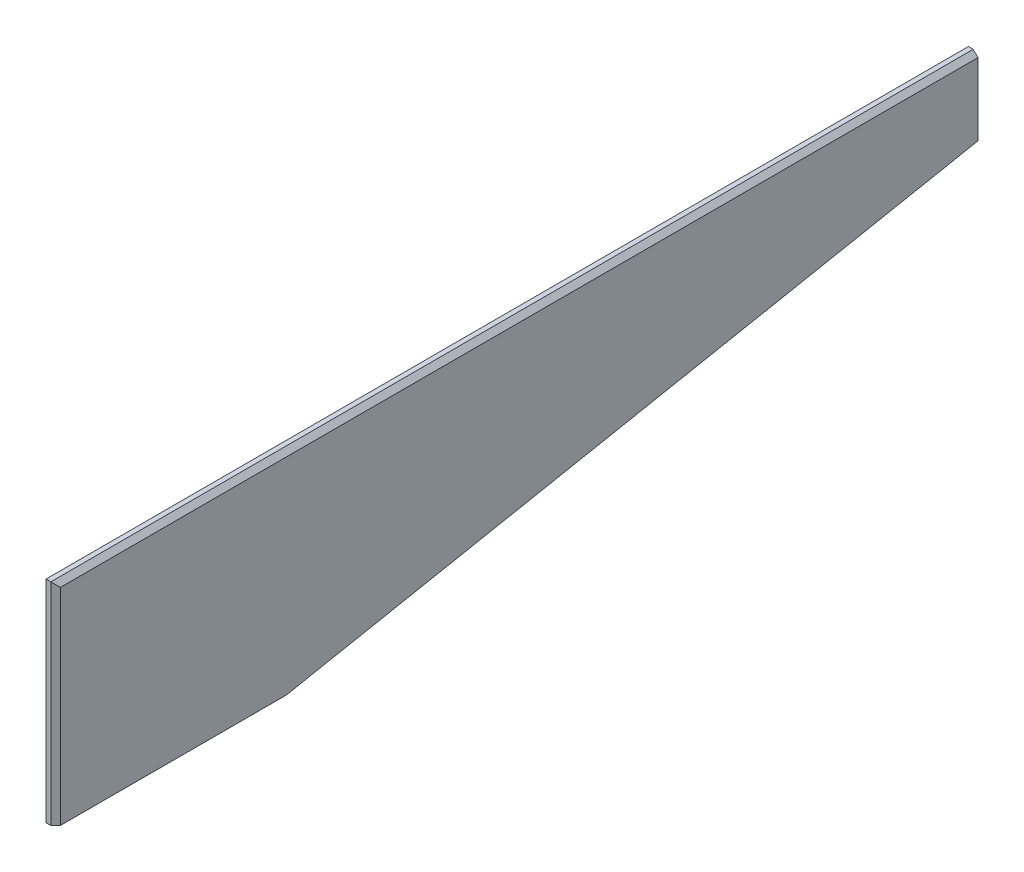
ISO-10303-21;
HEADER;
FILE_DESCRIPTION(('STEP AP214'),'2;1');
FILE_NAME('part.step','',(''),(''),'','','');
FILE_SCHEMA(('AUTOMOTIVE_DESIGN { 1 0 10303 214 1 1 1 1 }'));
ENDSEC;
DATA;
#1=APPLICATION_CONTEXT('core data for automotive mechanical design processes');
#2=APPLICATION_PROTOCOL_DEFINITION('international standard','automotive_design',2000,#1);
#3=PRODUCT_CONTEXT('',#1,'mechanical');
#4=PRODUCT('Part','Part','',(#3));
#5=PRODUCT_RELATED_PRODUCT_CATEGORY('part','',(#4));
#6=PRODUCT_DEFINITION_FORMATION('','',#4);
#7=PRODUCT_DEFINITION_CONTEXT('part definition',#1,'design');
#8=PRODUCT_DEFINITION('design','',#6,#7);
#9=PRODUCT_DEFINITION_SHAPE('','',#8);
#10=(LENGTH_UNIT() NAMED_UNIT(*) SI_UNIT(.MILLI.,.METRE.));
#11=(NAMED_UNIT(*) PLANE_ANGLE_UNIT() SI_UNIT($,.RADIAN.));
#12=(NAMED_UNIT(*) SI_UNIT($,.STERADIAN.) SOLID_ANGLE_UNIT());
#13=UNCERTAINTY_MEASURE_WITH_UNIT(LENGTH_MEASURE(1.E-05),#10,'distance_accuracy_value','');
#14=(GEOMETRIC_REPRESENTATION_CONTEXT(3) GLOBAL_UNCERTAINTY_ASSIGNED_CONTEXT((#13)) GLOBAL_UNIT_ASSIGNED_CONTEXT((#10,
#11,#12)) REPRESENTATION_CONTEXT('',''));
#15=CARTESIAN_POINT('',(0.,0.,0.));
#16=DIRECTION('',(0.,0.,1.));
#17=DIRECTION('',(1.,0.,0.));
#18=AXIS2_PLACEMENT_3D('',#15,#16,#17);
#19=CARTESIAN_POINT('',(4.7625,-69.7230000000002,-104.188187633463));
#20=DIRECTION('',(0.,1.,0.));
#21=DIRECTION('',(0.,0.,1.));
#22=AXIS2_PLACEMENT_3D('',#19,#20,#21);
#23=PLANE('',#22);
#24=DIRECTION('',(-1.,0.,0.));
#25=VECTOR('',#24,1.);
#26=CARTESIAN_POINT('',(4.7625,-69.7230000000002,-104.188187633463));
#27=LINE('',#26,#25);
#28=CARTESIAN_POINT('',(1.58749999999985,-69.7230000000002,-104.188187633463));
#29=VERTEX_POINT('',#28);
#30=CARTESIAN_POINT('',(-1.5875000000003,-69.7230000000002,-104.188187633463));
#31=VERTEX_POINT('',#30);
#32=EDGE_CURVE('E213',#29,#31,#27,.T.);
#33=ORIENTED_EDGE('',*,*,#32,.T.);
#34=DIRECTION('',(-0.707106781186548,0.,-0.707106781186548));
#35=VECTOR('',#34,1.);
#36=CARTESIAN_POINT('',(-1.5875000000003,-69.7230000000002,-104.188187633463));
#37=LINE('',#36,#35);
#38=CARTESIAN_POINT('',(-4.7625,-69.7230000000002,-107.363187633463));
#39=VERTEX_POINT('',#38);
#40=EDGE_CURVE('E174',#31,#39,#37,.T.);
#41=ORIENTED_EDGE('',*,*,#40,.T.);
#42=DIRECTION('',(0.,0.,-1.));
#43=VECTOR('',#42,1.);
#44=CARTESIAN_POINT('',(-4.7625,-69.7230000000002,-104.188187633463));
#45=LINE('',#44,#43);
#46=CARTESIAN_POINT('',(-4.7625,-69.7230000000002,-256.588187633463));
#47=VERTEX_POINT('',#46);
#48=EDGE_CURVE('E136',#39,#47,#45,.T.);
#49=ORIENTED_EDGE('',*,*,#48,.T.);
#50=DIRECTION('',(-1.,0.,0.));
#51=VECTOR('',#50,1.);
#52=CARTESIAN_POINT('',(4.7625,-69.7230000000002,-256.588187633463));
#53=LINE('',#52,#51);
#54=CARTESIAN_POINT('',(4.7625,-69.7230000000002,-256.588187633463));
#55=VERTEX_POINT('',#54);
#56=EDGE_CURVE('E127',#55,#47,#53,.T.);
#57=ORIENTED_EDGE('',*,*,#56,.F.);
#58=DIRECTION('',(0.,0.,-1.));
#59=VECTOR('',#58,1.);
#60=CARTESIAN_POINT('',(4.7625,-69.7230000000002,-104.188187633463));
#61=LINE('',#60,#59);
#62=CARTESIAN_POINT('',(4.7625,-69.7230000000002,-107.363187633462));
#63=VERTEX_POINT('',#62);
#64=EDGE_CURVE('E114',#63,#55,#61,.T.);
#65=ORIENTED_EDGE('',*,*,#64,.F.);
#66=DIRECTION('',(0.707106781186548,0.,-0.707106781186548));
#67=VECTOR('',#66,1.);
#68=CARTESIAN_POINT('',(4.7625,-69.7230000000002,-107.363187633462));
#69=LINE('',#68,#67);
#70=EDGE_CURVE('E72',#63,#29,#69,.F.);
#71=ORIENTED_EDGE('',*,*,#70,.T.);
#72=EDGE_LOOP('',(#33,#41,#49,#57,#65,#71));
#73=FACE_BOUND('',#72,.T.);
#74=ADVANCED_FACE('F47',(#73),#23,.F.);
#75=CARTESIAN_POINT('',(4.76249999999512,18.923,-713.788187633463));
#76=DIRECTION('',(0.,0.981717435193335,0.190344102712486));
#77=DIRECTION('',(0.,-0.190344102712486,0.981717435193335));
#78=AXIS2_PLACEMENT_3D('',#75,#76,#77);
#79=PLANE('',#78);
#80=DIRECTION('',(0.,0.190344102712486,-0.981717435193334));
#81=VECTOR('',#80,1.);
#82=CARTESIAN_POINT('',(-4.76250000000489,18.923,-713.788187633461));
#83=LINE('',#82,#81);
#84=CARTESIAN_POINT('',(-4.76250000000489,18.923,-713.788187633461));
#85=VERTEX_POINT('',#84);
#86=EDGE_CURVE('E189',#47,#85,#83,.T.);
#87=ORIENTED_EDGE('',*,*,#86,.T.);
#88=DIRECTION('',(-1.,0.,0.));
#89=VECTOR('',#88,1.);
#90=CARTESIAN_POINT('',(4.76249999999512,18.923,-713.788187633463));
#91=LINE('',#90,#89);
#92=CARTESIAN_POINT('',(4.76249999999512,18.923,-713.788187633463));
#93=VERTEX_POINT('',#92);
#94=EDGE_CURVE('E129',#93,#85,#91,.T.);
#95=ORIENTED_EDGE('',*,*,#94,.F.);
#96=DIRECTION('',(0.,0.190344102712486,-0.981717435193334));
#97=VECTOR('',#96,1.);
#98=CARTESIAN_POINT('',(4.76249999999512,18.923,-713.788187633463));
#99=LINE('',#98,#97);
#100=EDGE_CURVE('E117',#55,#93,#99,.T.);
#101=ORIENTED_EDGE('',*,*,#100,.F.);
#102=ORIENTED_EDGE('',*,*,#56,.T.);
#103=EDGE_LOOP('',(#87,#95,#101,#102));
#104=FACE_BOUND('',#103,.T.);
#105=ADVANCED_FACE('F126',(#104),#79,.F.);
#106=CARTESIAN_POINT('',(4.76249999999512,69.7230000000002,-713.788187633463));
#107=DIRECTION('',(0.,0.,1.));
#108=DIRECTION('',(1.,0.,0.));
#109=AXIS2_PLACEMENT_3D('',#106,#107,#108);
#110=PLANE('',#109);
#111=DIRECTION('',(0.,1.,0.));
#112=VECTOR('',#111,1.);
#113=CARTESIAN_POINT('',(-4.76250000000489,69.7230000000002,-713.788187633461));
#114=LINE('',#113,#112);
#115=CARTESIAN_POINT('',(-4.76250000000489,66.5480000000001,-713.788187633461));
#116=VERTEX_POINT('',#115);
#117=EDGE_CURVE('E122',#85,#116,#114,.T.);
#118=ORIENTED_EDGE('',*,*,#117,.T.);
#119=DIRECTION('',(0.707106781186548,0.707106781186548,0.));
#120=VECTOR('',#119,1.);
#121=CARTESIAN_POINT('',(-1.58750000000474,69.7229999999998,-713.788187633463));
#122=LINE('',#121,#120);
#123=CARTESIAN_POINT('',(-1.58750000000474,69.7230000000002,-713.788187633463));
#124=VERTEX_POINT('',#123);
#125=EDGE_CURVE('E163',#116,#124,#122,.T.);
#126=ORIENTED_EDGE('',*,*,#125,.T.);
#127=DIRECTION('',(-1.,0.,0.));
#128=VECTOR('',#127,1.);
#129=CARTESIAN_POINT('',(4.76249999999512,69.7230000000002,-713.788187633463));
#130=LINE('',#129,#128);
#131=CARTESIAN_POINT('',(1.58749999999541,69.7230000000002,-713.788187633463));
#132=VERTEX_POINT('',#131);
#133=EDGE_CURVE('E147',#132,#124,#130,.T.);
#134=ORIENTED_EDGE('',*,*,#133,.F.);
#135=DIRECTION('',(-0.707106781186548,0.707106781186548,0.));
#136=VECTOR('',#135,1.);
#137=CARTESIAN_POINT('',(4.76249999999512,66.5480000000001,-713.788187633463));
#138=LINE('',#137,#136);
#139=CARTESIAN_POINT('',(4.76249999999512,66.5480000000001,-713.788187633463));
#140=VERTEX_POINT('',#139);
#141=EDGE_CURVE('E160',#132,#140,#138,.F.);
#142=ORIENTED_EDGE('',*,*,#141,.T.);
#143=DIRECTION('',(0.,1.,0.));
#144=VECTOR('',#143,1.);
#145=CARTESIAN_POINT('',(4.76249999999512,69.7230000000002,-713.788187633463));
#146=LINE('',#145,#144);
#147=EDGE_CURVE('E132',#93,#140,#146,.T.);
#148=ORIENTED_EDGE('',*,*,#147,.F.);
#149=ORIENTED_EDGE('',*,*,#94,.T.);
#150=EDGE_LOOP('',(#118,#126,#134,#142,#148,#149));
#151=FACE_BOUND('',#150,.T.);
#152=ADVANCED_FACE('F207',(#151),#110,.F.);
#153=CARTESIAN_POINT('',(4.7625,69.7229999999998,-104.188187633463));
#154=DIRECTION('',(0.,-1.,0.));
#155=DIRECTION('',(0.,0.,-1.));
#156=AXIS2_PLACEMENT_3D('',#153,#154,#155);
#157=PLANE('',#156);
#158=ORIENTED_EDGE('',*,*,#133,.T.);
#159=DIRECTION('',(0.,0.,1.));
#160=VECTOR('',#159,1.);
#161=CARTESIAN_POINT('',(-1.5875000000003,69.7229999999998,-104.188187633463));
#162=LINE('',#161,#160);
#163=CARTESIAN_POINT('',(-1.5875000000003,69.7229999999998,-104.188187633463));
#164=VERTEX_POINT('',#163);
#165=EDGE_CURVE('E145',#124,#164,#162,.T.);
#166=ORIENTED_EDGE('',*,*,#165,.T.);
#167=DIRECTION('',(-1.,0.,0.));
#168=VECTOR('',#167,1.);
#169=CARTESIAN_POINT('',(4.7625,69.7229999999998,-104.188187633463));
#170=LINE('',#169,#168);
#171=CARTESIAN_POINT('',(1.58749999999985,69.7229999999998,-104.188187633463));
#172=VERTEX_POINT('',#171);
#173=EDGE_CURVE('E204',#172,#164,#170,.T.);
#174=ORIENTED_EDGE('',*,*,#173,.F.);
#175=DIRECTION('',(0.,0.,-1.));
#176=VECTOR('',#175,1.);
#177=CARTESIAN_POINT('',(1.58749999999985,69.7229999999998,-104.188187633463));
#178=LINE('',#177,#176);
#179=EDGE_CURVE('E139',#172,#132,#178,.T.);
#180=ORIENTED_EDGE('',*,*,#179,.T.);
#181=EDGE_LOOP('',(#158,#166,#174,#180));
#182=FACE_BOUND('',#181,.T.);
#183=ADVANCED_FACE('F202',(#182),#157,.F.);
#184=CARTESIAN_POINT('',(4.7625,-69.7230000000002,-104.188187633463));
#185=DIRECTION('',(0.,0.,-1.));
#186=DIRECTION('',(0.,1.,0.));
#187=AXIS2_PLACEMENT_3D('',#184,#185,#186);
#188=PLANE('',#187);
#189=ORIENTED_EDGE('',*,*,#173,.T.);
#190=DIRECTION('',(0.,-1.,0.));
#191=VECTOR('',#190,1.);
#192=CARTESIAN_POINT('',(-1.5875000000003,-69.7230000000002,-104.188187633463));
#193=LINE('',#192,#191);
#194=EDGE_CURVE('E169',#164,#31,#193,.T.);
#195=ORIENTED_EDGE('',*,*,#194,.T.);
#196=ORIENTED_EDGE('',*,*,#32,.F.);
#197=DIRECTION('',(0.,1.,0.));
#198=VECTOR('',#197,1.);
#199=CARTESIAN_POINT('',(1.58749999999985,-69.7230000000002,-104.188187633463));
#200=LINE('',#199,#198);
#201=EDGE_CURVE('E166',#29,#172,#200,.T.);
#202=ORIENTED_EDGE('',*,*,#201,.T.);
#203=EDGE_LOOP('',(#189,#195,#196,#202));
#204=FACE_BOUND('',#203,.T.);
#205=ADVANCED_FACE('F235',(#204),#188,.F.);
#206=CARTESIAN_POINT('',(4.7625,0.,0.));
#207=DIRECTION('',(-1.,0.,0.));
#208=DIRECTION('',(0.,0.,1.));
#209=AXIS2_PLACEMENT_3D('',#206,#207,#208);
#210=PLANE('',#209);
#211=DIRECTION('',(0.,0.,1.));
#212=VECTOR('',#211,1.);
#213=CARTESIAN_POINT('',(4.7625,66.5480000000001,0.));
#214=LINE('',#213,#212);
#215=CARTESIAN_POINT('',(4.7625,66.5480000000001,-107.363187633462));
#216=VERTEX_POINT('',#215);
#217=EDGE_CURVE('E58',#140,#216,#214,.T.);
#218=ORIENTED_EDGE('',*,*,#217,.T.);
#219=DIRECTION('',(0.,-1.,0.));
#220=VECTOR('',#219,1.);
#221=CARTESIAN_POINT('',(4.7625,0.,-107.363187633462));
#222=LINE('',#221,#220);
#223=EDGE_CURVE('E11',#216,#63,#222,.T.);
#224=ORIENTED_EDGE('',*,*,#223,.T.);
#225=ORIENTED_EDGE('',*,*,#64,.T.);
#226=ORIENTED_EDGE('',*,*,#100,.T.);
#227=ORIENTED_EDGE('',*,*,#147,.T.);
#228=EDGE_LOOP('',(#218,#224,#225,#226,#227));
#229=FACE_BOUND('',#228,.T.);
#230=ADVANCED_FACE('F116',(#229),#210,.F.);
#231=CARTESIAN_POINT('',(-4.7625,0.,0.));
#232=DIRECTION('',(-1.,0.,0.));
#233=DIRECTION('',(0.,0.,1.));
#234=AXIS2_PLACEMENT_3D('',#231,#232,#233);
#235=PLANE('',#234);
#236=DIRECTION('',(0.,1.,0.));
#237=VECTOR('',#236,1.);
#238=CARTESIAN_POINT('',(-4.7625,69.7229999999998,-107.363187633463));
#239=LINE('',#238,#237);
#240=CARTESIAN_POINT('',(-4.7625,66.5480000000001,-107.363187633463));
#241=VERTEX_POINT('',#240);
#242=EDGE_CURVE('E154',#39,#241,#239,.T.);
#243=ORIENTED_EDGE('',*,*,#242,.T.);
#244=DIRECTION('',(0.,0.,-1.));
#245=VECTOR('',#244,1.);
#246=CARTESIAN_POINT('',(-4.76250000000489,66.5480000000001,-713.788187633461));
#247=LINE('',#246,#245);
#248=EDGE_CURVE('E157',#241,#116,#247,.T.);
#249=ORIENTED_EDGE('',*,*,#248,.T.);
#250=ORIENTED_EDGE('',*,*,#117,.F.);
#251=ORIENTED_EDGE('',*,*,#86,.F.);
#252=ORIENTED_EDGE('',*,*,#48,.F.);
#253=EDGE_LOOP('',(#243,#249,#250,#251,#252));
#254=FACE_BOUND('',#253,.T.);
#255=ADVANCED_FACE('F227',(#254),#235,.T.);
#256=CARTESIAN_POINT('',(-1.5875000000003,-69.7230000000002,-104.188187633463));
#257=DIRECTION('',(-0.707106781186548,0.,0.707106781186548));
#258=DIRECTION('',(0.,1.,0.));
#259=AXIS2_PLACEMENT_3D('',#256,#257,#258);
#260=PLANE('',#259);
#261=ORIENTED_EDGE('',*,*,#40,.F.);
#262=ORIENTED_EDGE('',*,*,#194,.F.);
#263=DIRECTION('',(-0.577350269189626,-0.577350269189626,-0.577350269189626));
#264=VECTOR('',#263,1.);
#265=CARTESIAN_POINT('',(-48.0695000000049,23.2409999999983,-150.670187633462));
#266=LINE('',#265,#264);
#267=EDGE_CURVE('E178',#241,#164,#266,.F.);
#268=ORIENTED_EDGE('',*,*,#267,.F.);
#269=ORIENTED_EDGE('',*,*,#242,.F.);
#270=EDGE_LOOP('',(#261,#262,#268,#269));
#271=FACE_BOUND('',#270,.T.);
#272=ADVANCED_FACE('F232',(#271),#260,.T.);
#273=CARTESIAN_POINT('',(-1.5875000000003,69.7229999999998,-104.188187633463));
#274=DIRECTION('',(-0.707106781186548,0.707106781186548,0.));
#275=DIRECTION('',(0.,0.,-1.));
#276=AXIS2_PLACEMENT_3D('',#273,#274,#275);
#277=PLANE('',#276);
#278=ORIENTED_EDGE('',*,*,#125,.F.);
#279=ORIENTED_EDGE('',*,*,#248,.F.);
#280=ORIENTED_EDGE('',*,*,#267,.T.);
#281=ORIENTED_EDGE('',*,*,#165,.F.);
#282=EDGE_LOOP('',(#278,#279,#280,#281));
#283=FACE_BOUND('',#282,.T.);
#284=ADVANCED_FACE('F229',(#283),#277,.T.);
#285=CARTESIAN_POINT('',(4.7625,66.5480000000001,0.));
#286=DIRECTION('',(-0.707106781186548,-0.707106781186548,0.));
#287=DIRECTION('',(0.,0.,1.));
#288=AXIS2_PLACEMENT_3D('',#285,#286,#287);
#289=PLANE('',#288);
#290=ORIENTED_EDGE('',*,*,#141,.F.);
#291=ORIENTED_EDGE('',*,*,#179,.F.);
#292=DIRECTION('',(0.577350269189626,-0.577350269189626,-0.577350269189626));
#293=VECTOR('',#292,1.);
#294=CARTESIAN_POINT('',(-31.0252292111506,102.335729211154,-71.5754584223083));
#295=LINE('',#294,#293);
#296=EDGE_CURVE('E52',#216,#172,#295,.F.);
#297=ORIENTED_EDGE('',*,*,#296,.F.);
#298=ORIENTED_EDGE('',*,*,#217,.F.);
#299=EDGE_LOOP('',(#290,#291,#297,#298));
#300=FACE_BOUND('',#299,.T.);
#301=ADVANCED_FACE('F50',(#300),#289,.F.);
#302=CARTESIAN_POINT('',(4.7625,0.,-107.363187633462));
#303=DIRECTION('',(-0.707106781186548,0.,-0.707106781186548));
#304=DIRECTION('',(0.,-1.,0.));
#305=AXIS2_PLACEMENT_3D('',#302,#303,#304);
#306=PLANE('',#305);
#307=ORIENTED_EDGE('',*,*,#296,.T.);
#308=ORIENTED_EDGE('',*,*,#201,.F.);
#309=ORIENTED_EDGE('',*,*,#70,.F.);
#310=ORIENTED_EDGE('',*,*,#223,.F.);
#311=EDGE_LOOP('',(#307,#308,#309,#310));
#312=FACE_BOUND('',#311,.T.);
#313=ADVANCED_FACE('F194',(#312),#306,.F.);
#314=CLOSED_SHELL('',(#74,#105,#152,#183,#205,#230,#255,#272,#284,#301,#313));
#315=MANIFOLD_SOLID_BREP('B2',#314);
#316=ADVANCED_BREP_SHAPE_REPRESENTATION('',(#18,#315),#14);
#317=SHAPE_DEFINITION_REPRESENTATION(#9,#316);
ENDSEC;
END-ISO-10303-21;
